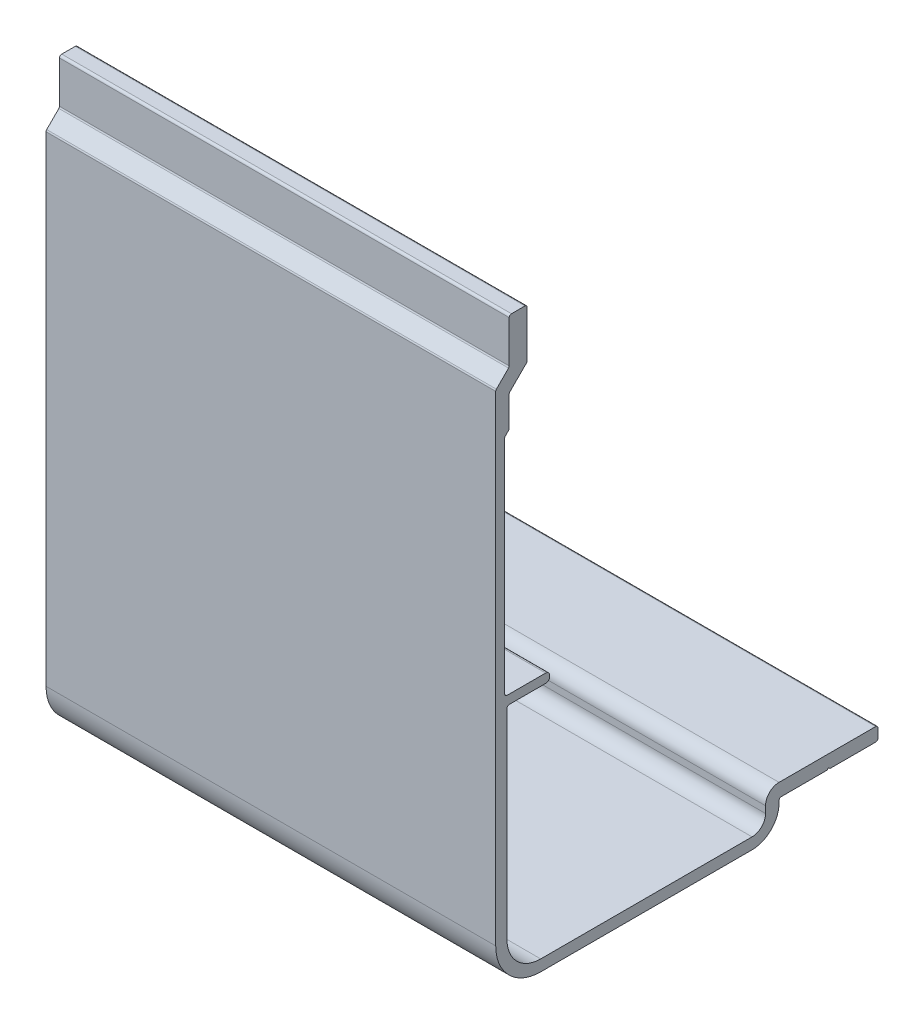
from build123d import *

# Parameters (mm, degrees)
EXTRUDE1_DEPTH = 50


with BuildPart() as part:
    # Sketch1 → Extrude1 (new, symmetric)
    with BuildSketch(Plane(origin=(0, 0, 0), x_dir=(0, 0, -1), z_dir=(1, 0, 0))):
        with BuildLine():
            Line((-2.821931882, -9.705933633), (44.178068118, -9.705933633))
            ThreePointArc((44.178068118, -9.705933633), (48.420708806, -7.94857432), (50.178068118, -3.705933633))
            Line((50.178068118, -3.705933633), (50.178068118, -3.205933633))
            ThreePointArc((50.178068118, -3.205933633), (50.324514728, -2.852380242), (50.678068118, -2.705933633))
            Line((50.678068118, -2.705933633), (60.878068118, -2.705933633))
            Line((60.878068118, -2.705933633), (61.178068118, -2.405933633))
            Line((61.178068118, -2.405933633), (61.478068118, -2.705933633))
            Line((61.478068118, -2.705933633), (71.678068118, -2.705933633))
            ThreePointArc((71.678068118, -2.705933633), (72.031621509, -2.559487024), (72.178068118, -2.205933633))
            Line((72.178068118, -2.205933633), (72.178068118, -0.205933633))
            ThreePointArc((72.178068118, -0.205933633), (72.031621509, 0.147619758), (71.678068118, 0.294066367))
            Line((71.678068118, 0.294066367), (50.178068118, 0.294066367))
            ThreePointArc((50.178068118, 0.294066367), (48.056747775, -0.584613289), (47.178068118, -2.705933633))
            Line((47.178068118, -2.705933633), (47.178068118, -4.205933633))
            ThreePointArc((47.178068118, -4.205933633), (46.299388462, -6.327253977), (44.178068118, -7.205933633))
            Line((44.178068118, -7.205933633), (-2.821931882, -7.205933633))
            ThreePointArc((-2.821931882, -7.205933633), (-8.12523274, -5.009234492), (-10.321931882, 0.294066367))
            Line((-10.321931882, 0.294066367), (-10.321931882, 44.794066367))
            ThreePointArc((-10.321931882, 44.794066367), (-10.175485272, 45.147619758), (-9.821931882, 45.294066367))
            Line((-9.821931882, 45.294066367), (-1.721931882, 45.294066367))
            ThreePointArc((-1.721931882, 45.294066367), (-1.085535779, 45.557670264), (-0.821931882, 46.194066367))
            Line((-0.821931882, 46.194066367), (-0.821931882, 46.394066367))
            ThreePointArc((-0.821931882, 46.394066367), (-1.085535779, 47.03046247), (-1.721931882, 47.294066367))
            Line((-1.721931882, 47.294066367), (-10.321931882, 47.294066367))
            ThreePointArc((-10.321931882, 47.294066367), (-10.675485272, 47.440512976), (-10.821931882, 47.794066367))
            Line((-10.821931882, 47.794066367), (-10.821931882, 97.086959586))
            ThreePointArc((-10.821931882, 97.086959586), (-10.783871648, 97.278301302), (-10.675485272, 97.440512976))
            Line((-10.675485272, 97.440512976), (-9.968378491, 98.147619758))
            ThreePointArc((-9.968378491, 98.147619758), (-9.859992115, 98.309831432), (-9.821931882, 98.501173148))
            Line((-9.821931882, 98.501173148), (-9.821931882, 105.086959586))
            ThreePointArc((-9.821931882, 105.086959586), (-9.783871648, 105.278301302), (-9.675485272, 105.440512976))
            Line((-9.675485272, 105.440512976), (-5.968378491, 109.147619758))
            ThreePointArc((-5.968378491, 109.147619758), (-5.859992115, 109.309831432), (-5.821931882, 109.501173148))
            Line((-5.821931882, 109.501173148), (-5.821931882, 119.794066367))
            ThreePointArc((-5.821931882, 119.794066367), (-5.968378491, 120.147619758), (-6.321931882, 120.294066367))
            Line((-6.321931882, 120.294066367), (-9.321931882, 120.294066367))
            ThreePointArc((-9.321931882, 120.294066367), (-9.675485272, 120.147619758), (-9.821931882, 119.794066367))
            Line((-9.821931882, 119.794066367), (-9.821931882, 110.501173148))
            ThreePointArc((-9.821931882, 110.501173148), (-9.859992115, 110.309831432), (-9.968378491, 110.147619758))
            Line((-9.968378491, 110.147619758), (-12.675485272, 107.440512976))
            ThreePointArc((-12.675485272, 107.440512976), (-12.783871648, 107.278301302), (-12.821931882, 107.086959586))
            Line((-12.821931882, 107.086959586), (-12.821931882, 0.294066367))
            ThreePointArc((-12.821931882, 0.294066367), (-9.892999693, -6.777001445), (-2.821931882, -9.705933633))
        make_face()
    extrude(amount=EXTRUDE1_DEPTH, both=True)


solid = part.part
